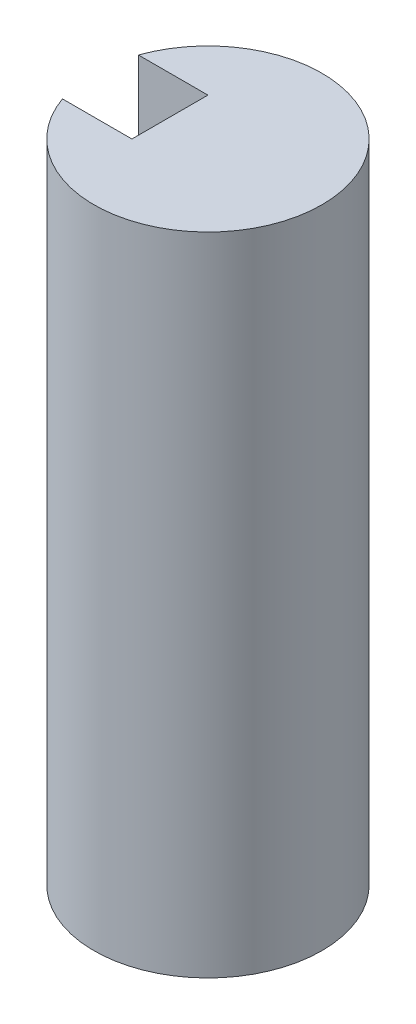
ISO-10303-21;
HEADER;
FILE_DESCRIPTION(('STEP AP214'),'2;1');
FILE_NAME('part.step','',(''),(''),'','','');
FILE_SCHEMA(('AUTOMOTIVE_DESIGN { 1 0 10303 214 1 1 1 1 }'));
ENDSEC;
DATA;
#1=APPLICATION_CONTEXT('core data for automotive mechanical design processes');
#2=APPLICATION_PROTOCOL_DEFINITION('international standard','automotive_design',2000,#1);
#3=PRODUCT_CONTEXT('',#1,'mechanical');
#4=PRODUCT('Part','Part','',(#3));
#5=PRODUCT_RELATED_PRODUCT_CATEGORY('part','',(#4));
#6=PRODUCT_DEFINITION_FORMATION('','',#4);
#7=PRODUCT_DEFINITION_CONTEXT('part definition',#1,'design');
#8=PRODUCT_DEFINITION('design','',#6,#7);
#9=PRODUCT_DEFINITION_SHAPE('','',#8);
#10=(LENGTH_UNIT() NAMED_UNIT(*) SI_UNIT(.MILLI.,.METRE.));
#11=(NAMED_UNIT(*) PLANE_ANGLE_UNIT() SI_UNIT($,.RADIAN.));
#12=(NAMED_UNIT(*) SI_UNIT($,.STERADIAN.) SOLID_ANGLE_UNIT());
#13=UNCERTAINTY_MEASURE_WITH_UNIT(LENGTH_MEASURE(1.E-05),#10,'distance_accuracy_value','');
#14=(GEOMETRIC_REPRESENTATION_CONTEXT(3) GLOBAL_UNCERTAINTY_ASSIGNED_CONTEXT((#13)) GLOBAL_UNIT_ASSIGNED_CONTEXT((#10,
#11,#12)) REPRESENTATION_CONTEXT('',''));
#15=CARTESIAN_POINT('',(0.,0.,0.));
#16=DIRECTION('',(0.,0.,1.));
#17=DIRECTION('',(1.,0.,0.));
#18=AXIS2_PLACEMENT_3D('',#15,#16,#17);
#19=CARTESIAN_POINT('',(1.5,4.5,0.));
#20=DIRECTION('',(0.,-1.,0.));
#21=DIRECTION('',(0.,0.,-1.));
#22=AXIS2_PLACEMENT_3D('',#19,#20,#21);
#23=CYLINDRICAL_SURFACE('',#22,1.5);
#24=DIRECTION('',(0.,-1.,0.));
#25=VECTOR('',#24,1.);
#26=CARTESIAN_POINT('',(0.0857864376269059,4.5,-0.500000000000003));
#27=LINE('',#26,#25);
#28=CARTESIAN_POINT('',(0.0857864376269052,-2.5,-0.5));
#29=VERTEX_POINT('',#28);
#30=CARTESIAN_POINT('',(0.085786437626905,-4.,-0.5));
#31=VERTEX_POINT('',#30);
#32=EDGE_CURVE('E152',#29,#31,#27,.T.);
#33=ORIENTED_EDGE('',*,*,#32,.F.);
#34=CARTESIAN_POINT('',(1.5,-2.5,0.));
#35=DIRECTION('',(0.,1.,0.));
#36=DIRECTION('',(0.,0.,1.));
#37=AXIS2_PLACEMENT_3D('',#34,#35,#36);
#38=CIRCLE('',#37,1.5);
#39=CARTESIAN_POINT('',(0.0857864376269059,-2.5,0.5));
#40=VERTEX_POINT('',#39);
#41=EDGE_CURVE('E44',#29,#40,#38,.T.);
#42=ORIENTED_EDGE('',*,*,#41,.T.);
#43=DIRECTION('',(0.,-1.,0.));
#44=VECTOR('',#43,1.);
#45=CARTESIAN_POINT('',(0.0857864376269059,4.5,0.500000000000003));
#46=LINE('',#45,#44);
#47=CARTESIAN_POINT('',(0.085786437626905,-4.,0.5));
#48=VERTEX_POINT('',#47);
#49=EDGE_CURVE('E149',#40,#48,#46,.T.);
#50=ORIENTED_EDGE('',*,*,#49,.T.);
#51=CARTESIAN_POINT('',(1.5,-4.,0.));
#52=DIRECTION('',(0.,1.,0.));
#53=DIRECTION('',(0.,0.,1.));
#54=AXIS2_PLACEMENT_3D('',#51,#52,#53);
#55=CIRCLE('',#54,1.5);
#56=EDGE_CURVE('E154',#48,#31,#55,.T.);
#57=ORIENTED_EDGE('',*,*,#56,.T.);
#58=EDGE_LOOP('',(#33,#42,#50,#57));
#59=FACE_BOUND('',#58,.T.);
#60=DIRECTION('',(0.,-1.,0.));
#61=VECTOR('',#60,1.);
#62=CARTESIAN_POINT('',(0.0857864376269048,4.5,0.5));
#63=LINE('',#62,#61);
#64=CARTESIAN_POINT('',(0.0857864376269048,4.5,0.5));
#65=VERTEX_POINT('',#64);
#66=CARTESIAN_POINT('',(0.0857864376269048,3.,0.5));
#67=VERTEX_POINT('',#66);
#68=EDGE_CURVE('E121',#65,#67,#63,.T.);
#69=ORIENTED_EDGE('',*,*,#68,.T.);
#70=CARTESIAN_POINT('',(1.5,3.,0.));
#71=DIRECTION('',(0.,-1.,0.));
#72=DIRECTION('',(0.,0.,-1.));
#73=AXIS2_PLACEMENT_3D('',#70,#71,#72);
#74=CIRCLE('',#73,1.5);
#75=CARTESIAN_POINT('',(0.0857864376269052,3.,-0.5));
#76=VERTEX_POINT('',#75);
#77=EDGE_CURVE('E11',#67,#76,#74,.T.);
#78=ORIENTED_EDGE('',*,*,#77,.T.);
#79=DIRECTION('',(0.,-1.,0.));
#80=VECTOR('',#79,1.);
#81=CARTESIAN_POINT('',(0.0857864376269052,4.5,-0.5));
#82=LINE('',#81,#80);
#83=CARTESIAN_POINT('',(0.0857864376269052,4.5,-0.5));
#84=VERTEX_POINT('',#83);
#85=EDGE_CURVE('E107',#84,#76,#82,.T.);
#86=ORIENTED_EDGE('',*,*,#85,.F.);
#87=CARTESIAN_POINT('',(1.5,4.5,0.));
#88=DIRECTION('',(0.,1.,0.));
#89=DIRECTION('',(0.,0.,1.));
#90=AXIS2_PLACEMENT_3D('',#87,#88,#89);
#91=CIRCLE('',#90,1.5);
#92=EDGE_CURVE('E157',#65,#84,#91,.T.);
#93=ORIENTED_EDGE('',*,*,#92,.F.);
#94=EDGE_LOOP('',(#69,#78,#86,#93));
#95=FACE_BOUND('',#94,.T.);
#96=ADVANCED_FACE('F37',(#59,#95),#23,.T.);
#97=CARTESIAN_POINT('',(1.5,4.5,0.));
#98=DIRECTION('',(0.,1.,0.));
#99=DIRECTION('',(0.,0.,1.));
#100=AXIS2_PLACEMENT_3D('',#97,#98,#99);
#101=PLANE('',#100);
#102=ORIENTED_EDGE('',*,*,#92,.T.);
#103=DIRECTION('',(-1.,0.,0.));
#104=VECTOR('',#103,1.);
#105=CARTESIAN_POINT('',(1.,4.5,-0.5));
#106=LINE('',#105,#104);
#107=CARTESIAN_POINT('',(1.,4.5,-0.5));
#108=VERTEX_POINT('',#107);
#109=EDGE_CURVE('E110',#108,#84,#106,.T.);
#110=ORIENTED_EDGE('',*,*,#109,.F.);
#111=DIRECTION('',(0.,0.,1.));
#112=VECTOR('',#111,1.);
#113=CARTESIAN_POINT('',(1.,4.5,-0.5));
#114=LINE('',#113,#112);
#115=CARTESIAN_POINT('',(1.,4.5,0.5));
#116=VERTEX_POINT('',#115);
#117=EDGE_CURVE('E115',#108,#116,#114,.T.);
#118=ORIENTED_EDGE('',*,*,#117,.T.);
#119=DIRECTION('',(-1.,0.,0.));
#120=VECTOR('',#119,1.);
#121=CARTESIAN_POINT('',(1.,4.5,0.5));
#122=LINE('',#121,#120);
#123=EDGE_CURVE('E254',#116,#65,#122,.T.);
#124=ORIENTED_EDGE('',*,*,#123,.T.);
#125=EDGE_LOOP('',(#102,#110,#118,#124));
#126=FACE_BOUND('',#125,.T.);
#127=ADVANCED_FACE('F187',(#126),#101,.T.);
#128=CARTESIAN_POINT('',(1.5,-4.,0.));
#129=DIRECTION('',(0.,1.,0.));
#130=DIRECTION('',(0.,0.,1.));
#131=AXIS2_PLACEMENT_3D('',#128,#129,#130);
#132=PLANE('',#131);
#133=DIRECTION('',(-1.,0.,0.));
#134=VECTOR('',#133,1.);
#135=CARTESIAN_POINT('',(1.,-4.,-0.5));
#136=LINE('',#135,#134);
#137=CARTESIAN_POINT('',(1.,-4.,-0.5));
#138=VERTEX_POINT('',#137);
#139=EDGE_CURVE('E59',#138,#31,#136,.T.);
#140=ORIENTED_EDGE('',*,*,#139,.T.);
#141=ORIENTED_EDGE('',*,*,#56,.F.);
#142=DIRECTION('',(-1.,0.,0.));
#143=VECTOR('',#142,1.);
#144=CARTESIAN_POINT('',(1.,-4.,0.5));
#145=LINE('',#144,#143);
#146=CARTESIAN_POINT('',(1.,-4.,0.5));
#147=VERTEX_POINT('',#146);
#148=EDGE_CURVE('E140',#147,#48,#145,.T.);
#149=ORIENTED_EDGE('',*,*,#148,.F.);
#150=DIRECTION('',(0.,0.,-1.));
#151=VECTOR('',#150,1.);
#152=CARTESIAN_POINT('',(1.,-4.,0.));
#153=LINE('',#152,#151);
#154=EDGE_CURVE('E129',#147,#138,#153,.T.);
#155=ORIENTED_EDGE('',*,*,#154,.T.);
#156=EDGE_LOOP('',(#140,#141,#149,#155));
#157=FACE_BOUND('',#156,.T.);
#158=ADVANCED_FACE('F174',(#157),#132,.F.);
#159=CARTESIAN_POINT('',(1.,-2.5,0.));
#160=DIRECTION('',(0.,1.,0.));
#161=DIRECTION('',(0.,0.,1.));
#162=AXIS2_PLACEMENT_3D('',#159,#160,#161);
#163=PLANE('',#162);
#164=DIRECTION('',(-1.,0.,0.));
#165=VECTOR('',#164,1.);
#166=CARTESIAN_POINT('',(1.,-2.5,-0.5));
#167=LINE('',#166,#165);
#168=CARTESIAN_POINT('',(1.,-2.5,-0.5));
#169=VERTEX_POINT('',#168);
#170=EDGE_CURVE('E145',#169,#29,#167,.T.);
#171=ORIENTED_EDGE('',*,*,#170,.F.);
#172=DIRECTION('',(0.,0.,-1.));
#173=VECTOR('',#172,1.);
#174=CARTESIAN_POINT('',(1.,-2.5,0.));
#175=LINE('',#174,#173);
#176=CARTESIAN_POINT('',(1.,-2.5,0.5));
#177=VERTEX_POINT('',#176);
#178=EDGE_CURVE('E134',#177,#169,#175,.T.);
#179=ORIENTED_EDGE('',*,*,#178,.F.);
#180=DIRECTION('',(-1.,0.,0.));
#181=VECTOR('',#180,1.);
#182=CARTESIAN_POINT('',(1.,-2.5,0.5));
#183=LINE('',#182,#181);
#184=EDGE_CURVE('E142',#177,#40,#183,.T.);
#185=ORIENTED_EDGE('',*,*,#184,.T.);
#186=ORIENTED_EDGE('',*,*,#41,.F.);
#187=EDGE_LOOP('',(#171,#179,#185,#186));
#188=FACE_BOUND('',#187,.T.);
#189=ADVANCED_FACE('F166',(#188),#163,.F.);
#190=CARTESIAN_POINT('',(1.,0.,-0.500000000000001));
#191=DIRECTION('',(0.,0.,1.));
#192=DIRECTION('',(0.,-1.,0.));
#193=AXIS2_PLACEMENT_3D('',#190,#191,#192);
#194=PLANE('',#193);
#195=ORIENTED_EDGE('',*,*,#32,.T.);
#196=ORIENTED_EDGE('',*,*,#139,.F.);
#197=DIRECTION('',(0.,1.,0.));
#198=VECTOR('',#197,1.);
#199=CARTESIAN_POINT('',(1.,0.,-0.500000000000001));
#200=LINE('',#199,#198);
#201=EDGE_CURVE('E132',#138,#169,#200,.T.);
#202=ORIENTED_EDGE('',*,*,#201,.T.);
#203=ORIENTED_EDGE('',*,*,#170,.T.);
#204=EDGE_LOOP('',(#195,#196,#202,#203));
#205=FACE_BOUND('',#204,.T.);
#206=ADVANCED_FACE('F168',(#205),#194,.T.);
#207=CARTESIAN_POINT('',(1.,0.,0.500000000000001));
#208=DIRECTION('',(0.,0.,1.));
#209=DIRECTION('',(0.,-1.,0.));
#210=AXIS2_PLACEMENT_3D('',#207,#208,#209);
#211=PLANE('',#210);
#212=ORIENTED_EDGE('',*,*,#184,.F.);
#213=DIRECTION('',(0.,1.,0.));
#214=VECTOR('',#213,1.);
#215=CARTESIAN_POINT('',(1.,0.,0.500000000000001));
#216=LINE('',#215,#214);
#217=EDGE_CURVE('E137',#147,#177,#216,.T.);
#218=ORIENTED_EDGE('',*,*,#217,.F.);
#219=ORIENTED_EDGE('',*,*,#148,.T.);
#220=ORIENTED_EDGE('',*,*,#49,.F.);
#221=EDGE_LOOP('',(#212,#218,#219,#220));
#222=FACE_BOUND('',#221,.T.);
#223=ADVANCED_FACE('F176',(#222),#211,.F.);
#224=CARTESIAN_POINT('',(1.,0.,0.));
#225=DIRECTION('',(1.,0.,0.));
#226=DIRECTION('',(0.,0.,-1.));
#227=AXIS2_PLACEMENT_3D('',#224,#225,#226);
#228=PLANE('',#227);
#229=ORIENTED_EDGE('',*,*,#154,.F.);
#230=ORIENTED_EDGE('',*,*,#217,.T.);
#231=ORIENTED_EDGE('',*,*,#178,.T.);
#232=ORIENTED_EDGE('',*,*,#201,.F.);
#233=EDGE_LOOP('',(#229,#230,#231,#232));
#234=FACE_BOUND('',#233,.T.);
#235=ADVANCED_FACE('F170',(#234),#228,.F.);
#236=CARTESIAN_POINT('',(1.,3.,-0.5));
#237=DIRECTION('',(0.,-1.,0.));
#238=DIRECTION('',(0.,0.,-1.));
#239=AXIS2_PLACEMENT_3D('',#236,#237,#238);
#240=PLANE('',#239);
#241=DIRECTION('',(-1.,0.,0.));
#242=VECTOR('',#241,1.);
#243=CARTESIAN_POINT('',(1.,3.,0.5));
#244=LINE('',#243,#242);
#245=CARTESIAN_POINT('',(1.,3.,0.5));
#246=VERTEX_POINT('',#245);
#247=EDGE_CURVE('E117',#246,#67,#244,.T.);
#248=ORIENTED_EDGE('',*,*,#247,.F.);
#249=DIRECTION('',(0.,0.,1.));
#250=VECTOR('',#249,1.);
#251=CARTESIAN_POINT('',(1.,3.,-0.5));
#252=LINE('',#251,#250);
#253=CARTESIAN_POINT('',(1.,3.,-0.5));
#254=VERTEX_POINT('',#253);
#255=EDGE_CURVE('E113',#254,#246,#252,.T.);
#256=ORIENTED_EDGE('',*,*,#255,.F.);
#257=DIRECTION('',(-1.,0.,0.));
#258=VECTOR('',#257,1.);
#259=CARTESIAN_POINT('',(1.,3.,-0.5));
#260=LINE('',#259,#258);
#261=EDGE_CURVE('E102',#254,#76,#260,.T.);
#262=ORIENTED_EDGE('',*,*,#261,.T.);
#263=ORIENTED_EDGE('',*,*,#77,.F.);
#264=EDGE_LOOP('',(#248,#256,#262,#263));
#265=FACE_BOUND('',#264,.T.);
#266=ADVANCED_FACE('F119',(#265),#240,.F.);
#267=CARTESIAN_POINT('',(1.,3.,-0.5));
#268=DIRECTION('',(0.,0.,1.));
#269=DIRECTION('',(1.,0.,0.));
#270=AXIS2_PLACEMENT_3D('',#267,#268,#269);
#271=PLANE('',#270);
#272=ORIENTED_EDGE('',*,*,#85,.T.);
#273=ORIENTED_EDGE('',*,*,#261,.F.);
#274=DIRECTION('',(0.,1.,0.));
#275=VECTOR('',#274,1.);
#276=CARTESIAN_POINT('',(1.,3.,-0.5));
#277=LINE('',#276,#275);
#278=EDGE_CURVE('E105',#254,#108,#277,.T.);
#279=ORIENTED_EDGE('',*,*,#278,.T.);
#280=ORIENTED_EDGE('',*,*,#109,.T.);
#281=EDGE_LOOP('',(#272,#273,#279,#280));
#282=FACE_BOUND('',#281,.T.);
#283=ADVANCED_FACE('F104',(#282),#271,.T.);
#284=CARTESIAN_POINT('',(1.,3.,0.5));
#285=DIRECTION('',(0.,0.,1.));
#286=DIRECTION('',(1.,0.,0.));
#287=AXIS2_PLACEMENT_3D('',#284,#285,#286);
#288=PLANE('',#287);
#289=ORIENTED_EDGE('',*,*,#123,.F.);
#290=DIRECTION('',(0.,1.,0.));
#291=VECTOR('',#290,1.);
#292=CARTESIAN_POINT('',(1.,3.,0.5));
#293=LINE('',#292,#291);
#294=EDGE_CURVE('E51',#246,#116,#293,.T.);
#295=ORIENTED_EDGE('',*,*,#294,.F.);
#296=ORIENTED_EDGE('',*,*,#247,.T.);
#297=ORIENTED_EDGE('',*,*,#68,.F.);
#298=EDGE_LOOP('',(#289,#295,#296,#297));
#299=FACE_BOUND('',#298,.T.);
#300=ADVANCED_FACE('F232',(#299),#288,.F.);
#301=CARTESIAN_POINT('',(1.,0.,0.));
#302=DIRECTION('',(-1.,0.,0.));
#303=DIRECTION('',(0.,0.,1.));
#304=AXIS2_PLACEMENT_3D('',#301,#302,#303);
#305=PLANE('',#304);
#306=ORIENTED_EDGE('',*,*,#255,.T.);
#307=ORIENTED_EDGE('',*,*,#294,.T.);
#308=ORIENTED_EDGE('',*,*,#117,.F.);
#309=ORIENTED_EDGE('',*,*,#278,.F.);
#310=EDGE_LOOP('',(#306,#307,#308,#309));
#311=FACE_BOUND('',#310,.T.);
#312=ADVANCED_FACE('F112',(#311),#305,.T.);
#313=CLOSED_SHELL('',(#96,#127,#158,#189,#206,#223,#235,#266,#283,#300,#312));
#314=MANIFOLD_SOLID_BREP('B2',#313);
#315=ADVANCED_BREP_SHAPE_REPRESENTATION('',(#18,#314),#14);
#316=SHAPE_DEFINITION_REPRESENTATION(#9,#315);
ENDSEC;
END-ISO-10303-21;
